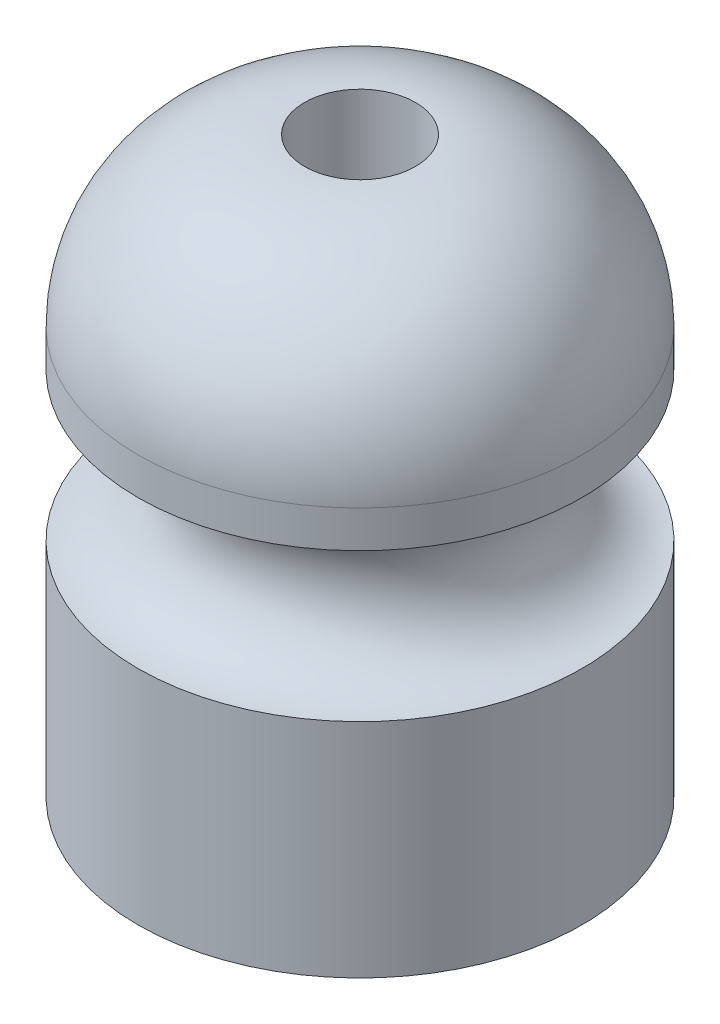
from build123d import *


with BuildPart() as part:
    # Esquisse1 → Base-R_volution (revolve)
    with BuildSketch(Plane.XY, mode=Mode.PRIVATE) as base_r_volution_sk:
        with BuildLine():
            Line((-21.325601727, 10), (-25, 0))
            Line((-25, 0), (-30, 0))
            Line((-30, 0), (-30, 30))
            ThreePointArc((-30, 30), (-20, 40), (-30, 50))
            Line((-30, 50), (-30, 55))
            ThreePointArc((-30, 55), (-23.409902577, 70.909902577), (-7.5, 77.5))
            Line((-7.5, 77.5), (-7.5, 10))
            Line((-7.5, 10), (-21.325601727, 10))
        make_face()
    revolve(base_r_volution_sk.sketch.rotate(Axis((0, 0, 0), (0, 1, 0)), 270), axis=Axis((0, 0, 0), (0, 1, 0)))


solid = part.part
